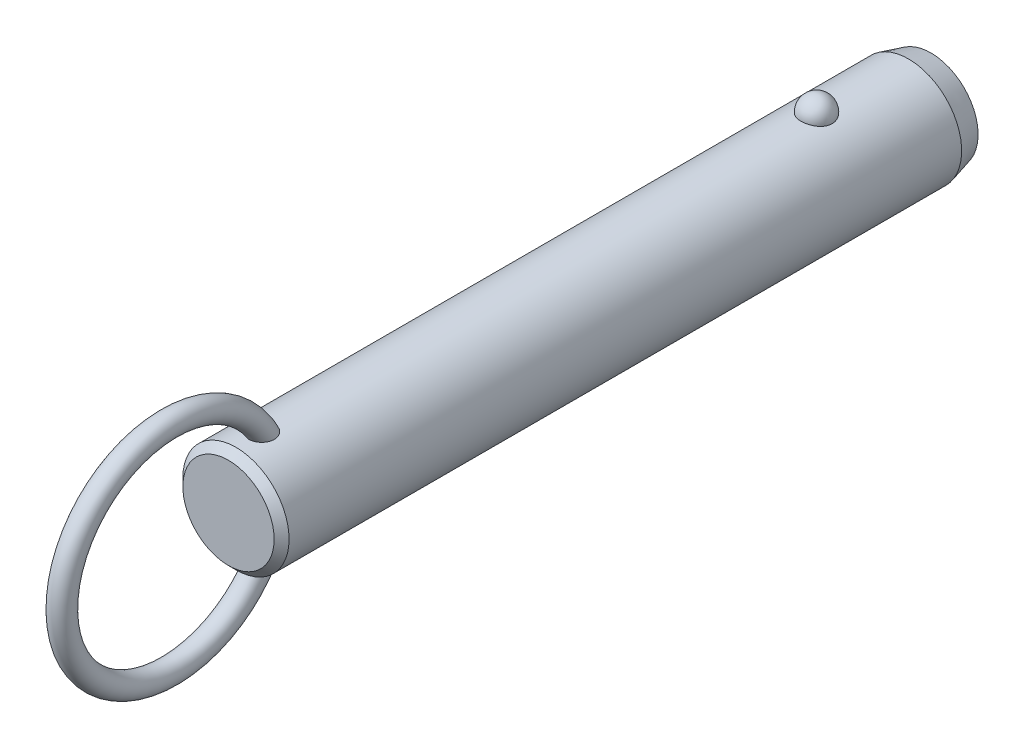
ISO-10303-21;
HEADER;
FILE_DESCRIPTION(('STEP AP214'),'2;1');
FILE_NAME('part.step','',(''),(''),'','','');
FILE_SCHEMA(('AUTOMOTIVE_DESIGN { 1 0 10303 214 1 1 1 1 }'));
ENDSEC;
DATA;
#1=APPLICATION_CONTEXT('core data for automotive mechanical design processes');
#2=APPLICATION_PROTOCOL_DEFINITION('international standard','automotive_design',2000,#1);
#3=PRODUCT_CONTEXT('',#1,'mechanical');
#4=PRODUCT('Part','Part','',(#3));
#5=PRODUCT_RELATED_PRODUCT_CATEGORY('part','',(#4));
#6=PRODUCT_DEFINITION_FORMATION('','',#4);
#7=PRODUCT_DEFINITION_CONTEXT('part definition',#1,'design');
#8=PRODUCT_DEFINITION('design','',#6,#7);
#9=PRODUCT_DEFINITION_SHAPE('','',#8);
#10=(LENGTH_UNIT() NAMED_UNIT(*) SI_UNIT(.MILLI.,.METRE.));
#11=(NAMED_UNIT(*) PLANE_ANGLE_UNIT() SI_UNIT($,.RADIAN.));
#12=(NAMED_UNIT(*) SI_UNIT($,.STERADIAN.) SOLID_ANGLE_UNIT());
#13=UNCERTAINTY_MEASURE_WITH_UNIT(LENGTH_MEASURE(1.E-05),#10,'distance_accuracy_value','');
#14=(GEOMETRIC_REPRESENTATION_CONTEXT(3) GLOBAL_UNCERTAINTY_ASSIGNED_CONTEXT((#13)) GLOBAL_UNIT_ASSIGNED_CONTEXT((#10,
#11,#12)) REPRESENTATION_CONTEXT('',''));
#15=CARTESIAN_POINT('',(0.,0.,0.));
#16=DIRECTION('',(0.,0.,1.));
#17=DIRECTION('',(1.,0.,0.));
#18=AXIS2_PLACEMENT_3D('',#15,#16,#17);
#19=CARTESIAN_POINT('',(0.,0.,68.6));
#20=DIRECTION('',(0.,0.,-1.));
#21=DIRECTION('',(-1.,0.,0.));
#22=AXIS2_PLACEMENT_3D('',#19,#20,#21);
#23=CYLINDRICAL_SURFACE('',#22,7.1);
#24=CARTESIAN_POINT('',(2.0769088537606,6.78943661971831,-2.1));
#25=CARTESIAN_POINT('',(2.07690739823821,6.78943796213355,-1.98268154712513));
#26=CARTESIAN_POINT('',(2.06738130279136,6.79237331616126,-1.86534506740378));
#27=CARTESIAN_POINT('',(2.0295040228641,6.8037853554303,-1.63400788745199));
#28=CARTESIAN_POINT('',(2.00114757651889,6.81226358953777,-1.52000812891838));
#29=CARTESIAN_POINT('',(1.92632025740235,6.83379798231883,-1.29863433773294));
#30=CARTESIAN_POINT('',(1.87985726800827,6.84685214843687,-1.19125744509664));
#31=CARTESIAN_POINT('',(1.76995205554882,6.87608091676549,-0.98604657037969));
#32=CARTESIAN_POINT('',(1.70650980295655,6.8922555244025,-0.88821260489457));
#33=CARTESIAN_POINT('',(1.5638119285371,6.92602930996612,-0.704242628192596));
#34=CARTESIAN_POINT('',(1.4844714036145,6.94363582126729,-0.618173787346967));
#35=CARTESIAN_POINT('',(1.31221746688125,6.97823658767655,-0.460740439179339));
#36=CARTESIAN_POINT('',(1.21930409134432,6.99523084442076,-0.389375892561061));
#37=CARTESIAN_POINT('',(1.02268781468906,7.02666176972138,-0.263547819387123));
#38=CARTESIAN_POINT('',(0.91902009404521,7.04110638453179,-0.209031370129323));
#39=CARTESIAN_POINT('',(0.703548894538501,7.06588726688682,-0.118163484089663));
#40=CARTESIAN_POINT('',(0.591746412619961,7.07622403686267,-0.0818098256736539));
#41=CARTESIAN_POINT('',(0.365557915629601,7.09147068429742,-0.0288711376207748));
#42=CARTESIAN_POINT('',(0.251267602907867,7.09648447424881,-0.0119070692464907));
#43=CARTESIAN_POINT('',(0.0213499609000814,7.10089837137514,0.00304925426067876));
#44=CARTESIAN_POINT('',(-0.0942772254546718,7.10029907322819,0.00104351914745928));
#45=CARTESIAN_POINT('',(-0.321651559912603,7.09360829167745,-0.0216931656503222));
#46=CARTESIAN_POINT('',(-0.433431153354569,7.08760388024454,-0.0421272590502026));
#47=CARTESIAN_POINT('',(-0.651862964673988,7.07086131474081,-0.100729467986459));
#48=CARTESIAN_POINT('',(-0.758515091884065,7.06012307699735,-0.138897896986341));
#49=CARTESIAN_POINT('',(-0.964449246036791,7.03496097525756,-0.232213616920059));
#50=CARTESIAN_POINT('',(-1.06368095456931,7.02051445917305,-0.287465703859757));
#51=CARTESIAN_POINT('',(-1.25145353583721,6.98948740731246,-0.413383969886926));
#52=CARTESIAN_POINT('',(-1.33999321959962,6.97290663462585,-0.48405186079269));
#53=CARTESIAN_POINT('',(-1.50591604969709,6.93898770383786,-0.640594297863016));
#54=CARTESIAN_POINT('',(-1.58302488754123,6.92164094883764,-0.726757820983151));
#55=CARTESIAN_POINT('',(-1.72189320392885,6.8884103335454,-0.91092752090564));
#56=CARTESIAN_POINT('',(-1.78365144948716,6.87252659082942,-1.008934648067));
#57=CARTESIAN_POINT('',(-1.89101272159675,6.84377189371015,-1.21549497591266));
#58=CARTESIAN_POINT('',(-1.93639553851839,6.83094274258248,-1.32416860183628));
#59=CARTESIAN_POINT('',(-2.00874275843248,6.81002070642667,-1.54791500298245));
#60=CARTESIAN_POINT('',(-2.03570774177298,6.80192767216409,-1.66298757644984));
#61=CARTESIAN_POINT('',(-2.07047276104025,6.7914266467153,-1.89571453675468));
#62=CARTESIAN_POINT('',(-2.07835878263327,6.78899315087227,-2.01335491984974));
#63=CARTESIAN_POINT('',(-2.07502083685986,6.79001409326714,-2.24833570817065));
#64=CARTESIAN_POINT('',(-2.06379746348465,6.7934683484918,-2.36567612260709));
#65=CARTESIAN_POINT('',(-2.02263913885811,6.80583442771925,-2.59603194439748));
#66=CARTESIAN_POINT('',(-1.99281127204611,6.81471501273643,-2.70906820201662));
#67=CARTESIAN_POINT('',(-1.91526639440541,6.83691232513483,-2.92836575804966));
#68=CARTESIAN_POINT('',(-1.8675486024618,6.85022924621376,-3.03462676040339));
#69=CARTESIAN_POINT('',(-1.75504492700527,6.87991336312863,-3.23806487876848));
#70=CARTESIAN_POINT('',(-1.69015924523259,6.89629822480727,-3.33518422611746));
#71=CARTESIAN_POINT('',(-1.54505404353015,6.93024852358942,-3.51697105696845));
#72=CARTESIAN_POINT('',(-1.46483385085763,6.94781401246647,-3.60163799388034));
#73=CARTESIAN_POINT('',(-1.29071406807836,6.98225977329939,-3.75654119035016));
#74=CARTESIAN_POINT('',(-1.19675650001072,6.99913673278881,-3.82671308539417));
#75=CARTESIAN_POINT('',(-0.997940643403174,7.03023618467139,-3.9501837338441));
#76=CARTESIAN_POINT('',(-0.89308318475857,7.04445887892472,-4.00348377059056));
#77=CARTESIAN_POINT('',(-0.676902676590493,7.06848365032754,-4.09107242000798));
#78=CARTESIAN_POINT('',(-0.565686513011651,7.0783430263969,-4.12560889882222));
#79=CARTESIAN_POINT('',(-0.338739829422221,7.09282534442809,-4.17575450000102));
#80=CARTESIAN_POINT('',(-0.223009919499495,7.09744899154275,-4.19136617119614));
#81=CARTESIAN_POINT('',(0.00707628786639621,7.10090930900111,-4.20307965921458));
#82=CARTESIAN_POINT('',(0.121410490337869,7.09986531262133,-4.19958377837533));
#83=CARTESIAN_POINT('',(0.347815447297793,7.092380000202,-4.17411564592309));
#84=CARTESIAN_POINT('',(0.459886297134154,7.08593891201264,-4.15214417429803));
#85=CARTESIAN_POINT('',(0.678084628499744,7.06838983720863,-4.09049562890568));
#86=CARTESIAN_POINT('',(0.784237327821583,7.05730369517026,-4.05090137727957));
#87=CARTESIAN_POINT('',(0.988305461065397,7.03163139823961,-3.95511447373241));
#88=CARTESIAN_POINT('',(1.08622031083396,7.01704499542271,-3.89892064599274));
#89=CARTESIAN_POINT('',(1.27284490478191,6.98562668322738,-3.77035541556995));
#90=CARTESIAN_POINT('',(1.36137372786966,6.96876135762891,-3.69772964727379));
#91=CARTESIAN_POINT('',(1.52509486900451,6.93477412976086,-3.53878279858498));
#92=CARTESIAN_POINT('',(1.60028496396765,6.91765218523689,-3.45245943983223));
#93=CARTESIAN_POINT('',(1.73681688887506,6.88465753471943,-3.26658774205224));
#94=CARTESIAN_POINT('',(1.79785966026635,6.86881574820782,-3.16681408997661));
#95=CARTESIAN_POINT('',(1.90265327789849,6.84053157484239,-2.95814408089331));
#96=CARTESIAN_POINT('',(1.94640861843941,6.82808830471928,-2.84925010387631));
#97=CARTESIAN_POINT('',(2.01274378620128,6.80881460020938,-2.63454318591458));
#98=CARTESIAN_POINT('',(2.03676193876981,6.80160856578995,-2.52920574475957));
#99=CARTESIAN_POINT('',(2.06884490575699,6.79191902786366,-2.3159172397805));
#100=CARTESIAN_POINT('',(2.07691019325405,6.78943538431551,-2.20796625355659));
#101=CARTESIAN_POINT('',(2.0769088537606,6.78943661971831,-2.1));
#102=B_SPLINE_CURVE_WITH_KNOTS('',3,(#24,#25,#26,#27,#28,#29,#30,#31,#32,#33,#34,#35,#36,#37,
#38,#39,#40,#41,#42,#43,#44,#45,#46,#47,#48,#49,#50,#51,#52,#53,#54,#55,#56,#57,#58,#59,#60,#61,
#62,#63,#64,#65,#66,#67,#68,#69,#70,#71,#72,#73,#74,#75,#76,#77,#78,#79,#80,#81,#82,#83,#84,#85,
#86,#87,#88,#89,#90,#91,#92,#93,#94,#95,#96,#97,#98,#99,#100,#101),.UNSPECIFIED.,.T.,.F.,(4,2,2,
2,2,2,2,2,2,2,2,2,2,2,2,2,2,2,2,2,2,2,2,2,2,2,2,2,2,2,2,2,2,2,2,2,2,2,4),(0.,0.351568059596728,
0.703234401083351,1.05474780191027,1.40626181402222,1.75970563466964,2.11314851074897,
2.4654696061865,2.81774759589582,3.16301449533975,3.50824481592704,3.84801136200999,
4.18778391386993,4.52968352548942,4.87162112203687,5.22076181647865,5.56993054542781,
5.92363364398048,6.27732559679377,6.62942052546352,6.98150450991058,7.33158042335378,
7.68167162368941,8.03384443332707,8.38603269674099,8.73975272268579,9.09344583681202,
9.44234545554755,9.79119807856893,10.1327344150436,10.4742563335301,10.8141898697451,
11.1541474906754,11.4997793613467,11.8454687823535,12.1979079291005,12.5502553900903,
12.8738073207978,13.1973496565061),.UNSPECIFIED.);
#103=CARTESIAN_POINT('',(2.0769088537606,6.78943661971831,-2.1));
#104=VERTEX_POINT('',#103);
#105=EDGE_CURVE('E41',#104,#104,#102,.T.);
#106=ORIENTED_EDGE('',*,*,#105,.T.);
#107=EDGE_LOOP('',(#106));
#108=FACE_BOUND('',#107,.T.);
#109=CARTESIAN_POINT('',(0.,0.,75.52));
#110=DIRECTION('',(0.,0.,1.));
#111=DIRECTION('',(1.,0.,0.));
#112=AXIS2_PLACEMENT_3D('',#109,#110,#111);
#113=CIRCLE('',#112,7.1);
#114=CARTESIAN_POINT('',(7.1,0.,75.52));
#115=VERTEX_POINT('',#114);
#116=EDGE_CURVE('E10',#115,#115,#113,.F.);
#117=ORIENTED_EDGE('',*,*,#116,.T.);
#118=EDGE_LOOP('',(#117));
#119=FACE_BOUND('',#118,.T.);
#120=CARTESIAN_POINT('',(-0.429539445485,-7.08699541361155,70.3429212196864));
#121=CARTESIAN_POINT('',(-0.508331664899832,-7.08221999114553,70.3668764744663));
#122=CARTESIAN_POINT('',(-0.58503984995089,-7.07624016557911,70.3974570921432));
#123=CARTESIAN_POINT('',(-0.732082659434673,-7.06254296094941,70.4710242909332));
#124=CARTESIAN_POINT('',(-0.802417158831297,-7.05482554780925,70.5140111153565));
#125=CARTESIAN_POINT('',(-0.934722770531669,-7.03851844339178,70.6111135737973));
#126=CARTESIAN_POINT('',(-0.99670020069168,-7.02992941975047,70.6652207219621));
#127=CARTESIAN_POINT('',(-1.11079942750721,-7.01280697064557,70.7829676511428));
#128=CARTESIAN_POINT('',(-1.16292136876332,-7.00427354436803,70.8466072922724));
#129=CARTESIAN_POINT('',(-1.25705660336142,-6.98799959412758,70.9826870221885));
#130=CARTESIAN_POINT('',(-1.29888032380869,-6.98027525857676,71.0552598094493));
#131=CARTESIAN_POINT('',(-1.37069920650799,-6.96652886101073,71.2061686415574));
#132=CARTESIAN_POINT('',(-1.40069157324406,-6.96050720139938,71.2845060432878));
#133=CARTESIAN_POINT('',(-1.45043507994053,-6.95031881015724,71.4501903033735));
#134=CARTESIAN_POINT('',(-1.46937115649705,-6.94630231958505,71.5377897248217));
#135=CARTESIAN_POINT('',(-1.49424917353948,-6.94099239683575,71.7148714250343));
#136=CARTESIAN_POINT('',(-1.50018601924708,-6.93970003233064,71.8043544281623));
#137=CARTESIAN_POINT('',(-1.49978214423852,-6.93978815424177,71.9940607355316));
#138=CARTESIAN_POINT('',(-1.49187639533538,-6.94150934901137,72.094279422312));
#139=CARTESIAN_POINT('',(-1.46177925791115,-6.94790814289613,72.2924798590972));
#140=CARTESIAN_POINT('',(-1.43957541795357,-6.95258831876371,72.390459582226));
#141=CARTESIAN_POINT('',(-1.37783293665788,-6.96510647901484,72.5953629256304));
#142=CARTESIAN_POINT('',(-1.33634073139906,-6.97328848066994,72.7016801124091));
#143=CARTESIAN_POINT('',(-1.23686994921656,-6.99161706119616,72.9061777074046));
#144=CARTESIAN_POINT('',(-1.17889192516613,-7.00176357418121,73.0043583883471));
#145=CARTESIAN_POINT('',(-1.0587512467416,-7.02082898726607,73.1723743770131));
#146=CARTESIAN_POINT('',(-0.999247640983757,-7.02963746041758,73.2441230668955));
#147=CARTESIAN_POINT('',(-0.869494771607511,-7.04686074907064,73.3771959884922));
#148=CARTESIAN_POINT('',(-0.799263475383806,-7.05527619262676,73.4385372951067));
#149=CARTESIAN_POINT('',(-0.665408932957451,-7.06899457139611,73.5351316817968));
#150=CARTESIAN_POINT('',(-0.603817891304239,-7.07457275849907,73.5731512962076));
#151=CARTESIAN_POINT('',(-0.475172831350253,-7.08437420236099,73.6387581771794));
#152=CARTESIAN_POINT('',(-0.408123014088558,-7.08859848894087,73.6663533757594));
#153=CARTESIAN_POINT('',(-0.269431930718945,-7.09522749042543,73.7092569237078));
#154=CARTESIAN_POINT('',(-0.197757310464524,-7.09761688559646,73.7244618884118));
#155=CARTESIAN_POINT('',(-0.0527849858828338,-7.10017268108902,73.7407168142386));
#156=CARTESIAN_POINT('',(0.0205115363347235,-7.10034065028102,73.7417767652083));
#157=CARTESIAN_POINT('',(0.15642613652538,-7.09855986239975,73.7304619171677));
#158=CARTESIAN_POINT('',(0.219199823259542,-7.09688191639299,73.7198060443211));
#159=CARTESIAN_POINT('',(0.342134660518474,-7.09201880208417,73.6885379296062));
#160=CARTESIAN_POINT('',(0.402295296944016,-7.08883333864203,73.6679237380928));
#161=CARTESIAN_POINT('',(0.520687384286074,-7.08113868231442,73.6172125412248));
#162=CARTESIAN_POINT('',(0.578791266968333,-7.07658958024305,73.5868272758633));
#163=CARTESIAN_POINT('',(0.690173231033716,-7.06659708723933,73.5183678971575));
#164=CARTESIAN_POINT('',(0.743447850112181,-7.061153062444,73.4802883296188));
#165=CARTESIAN_POINT('',(0.870947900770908,-7.04680292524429,73.3765929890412));
#166=CARTESIAN_POINT('',(0.941828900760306,-7.0375580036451,73.3068972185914));
#167=CARTESIAN_POINT('',(1.07136606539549,-7.01900793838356,73.1569450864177));
#168=CARTESIAN_POINT('',(1.13000013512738,-7.00970271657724,73.0766700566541));
#169=CARTESIAN_POINT('',(1.23579584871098,-6.99183327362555,72.9068997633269));
#170=CARTESIAN_POINT('',(1.2827427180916,-6.98328455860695,72.8172696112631));
#171=CARTESIAN_POINT('',(1.36351442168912,-6.96796352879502,72.6321763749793));
#172=CARTESIAN_POINT('',(1.39733971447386,-6.96119115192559,72.5367134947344));
#173=CARTESIAN_POINT('',(1.45579181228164,-6.94922464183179,72.3253092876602));
#174=CARTESIAN_POINT('',(1.47790145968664,-6.94449000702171,72.208631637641));
#175=CARTESIAN_POINT('',(1.50168752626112,-6.93938731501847,71.9730153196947));
#176=CARTESIAN_POINT('',(1.50336085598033,-6.93901991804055,71.8540763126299));
#177=CARTESIAN_POINT('',(1.48486516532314,-6.9430010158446,71.6236079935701));
#178=CARTESIAN_POINT('',(1.46573441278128,-6.9471253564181,71.511995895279));
#179=CARTESIAN_POINT('',(1.40606892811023,-6.95944667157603,71.2948868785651));
#180=CARTESIAN_POINT('',(1.36556446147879,-6.96763788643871,71.1893815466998));
#181=CARTESIAN_POINT('',(1.27082700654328,-6.98548038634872,71.0042879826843));
#182=CARTESIAN_POINT('',(1.21949810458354,-6.99473841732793,70.9231719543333));
#183=CARTESIAN_POINT('',(1.10242050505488,-7.01414069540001,70.7722278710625));
#184=CARTESIAN_POINT('',(1.03668119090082,-7.02428436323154,70.7023925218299));
#185=CARTESIAN_POINT('',(0.900559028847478,-7.04295285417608,70.5835735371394));
#186=CARTESIAN_POINT('',(0.83142884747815,-7.05153466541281,70.5331573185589));
#187=CARTESIAN_POINT('',(0.68529187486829,-7.06723150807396,70.4451429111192));
#188=CARTESIAN_POINT('',(0.608287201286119,-7.0743469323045,70.4075412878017));
#189=CARTESIAN_POINT('',(0.451878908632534,-7.08602232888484,70.3474915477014));
#190=CARTESIAN_POINT('',(0.372686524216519,-7.09067127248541,70.3245088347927));
#191=CARTESIAN_POINT('',(0.211477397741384,-7.09730788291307,70.2920357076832));
#192=CARTESIAN_POINT('',(0.129460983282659,-7.09929585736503,70.2825437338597));
#193=CARTESIAN_POINT('',(-0.0332905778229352,-7.10037858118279,70.2773517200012));
#194=CARTESIAN_POINT('',(-0.11401636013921,-7.09953334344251,70.2813656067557));
#195=CARTESIAN_POINT('',(-0.273670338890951,-7.09517338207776,70.3024540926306));
#196=CARTESIAN_POINT('',(-0.352598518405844,-7.09165863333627,70.3195288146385));
#197=CARTESIAN_POINT('',(-0.429539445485,-7.08699541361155,70.3429212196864));
#198=B_SPLINE_CURVE_WITH_KNOTS('',3,(#120,#121,#122,#123,#124,#125,#126,#127,#128,#129,#130,
#131,#132,#133,#134,#135,#136,#137,#138,#139,#140,#141,#142,#143,#144,#145,#146,#147,#148,#149,
#150,#151,#152,#153,#154,#155,#156,#157,#158,#159,#160,#161,#162,#163,#164,#165,#166,#167,#168,
#169,#170,#171,#172,#173,#174,#175,#176,#177,#178,#179,#180,#181,#182,#183,#184,#185,#186,#187,
#188,#189,#190,#191,#192,#193,#194,#195,#196,#197),.UNSPECIFIED.,.T.,.F.,(4,2,2,2,2,2,2,2,2,2,2,
2,2,2,2,2,2,2,2,2,2,2,2,2,2,2,2,2,2,2,2,2,2,2,2,2,2,2,4),(0.,0.247183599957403,
0.494372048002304,0.741372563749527,0.988369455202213,1.23962059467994,1.49093106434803,
1.75897818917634,2.02713035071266,2.32758265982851,2.62829697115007,2.97008736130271,
3.31186629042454,3.59175319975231,3.87117637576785,4.08813841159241,4.30493502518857,
4.52352259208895,4.74195577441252,4.9321532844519,5.12238804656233,5.31884850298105,
5.51544871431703,5.81332317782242,6.11173048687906,6.4152726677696,6.71880423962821,
7.07358156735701,7.42841252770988,7.76631485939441,8.10373999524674,8.39142246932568,
8.67891817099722,8.93560332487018,9.19221962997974,9.43881106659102,9.68537399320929,
9.92674752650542,10.1681233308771),.UNSPECIFIED.);
#199=CARTESIAN_POINT('',(-0.429539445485,-7.08699541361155,70.3429212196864));
#200=VERTEX_POINT('',#199);
#201=EDGE_CURVE('E59',#200,#200,#198,.T.);
#202=ORIENTED_EDGE('',*,*,#201,.T.);
#203=EDGE_LOOP('',(#202));
#204=FACE_BOUND('',#203,.T.);
#205=CARTESIAN_POINT('',(-0.429539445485,7.08699541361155,70.3429212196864));
#206=CARTESIAN_POINT('',(-0.351665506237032,7.09171429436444,70.3192469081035));
#207=CARTESIAN_POINT('',(-0.271733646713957,7.09525896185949,70.3020369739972));
#208=CARTESIAN_POINT('',(-0.110026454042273,7.09960839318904,70.2810059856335));
#209=CARTESIAN_POINT('',(-0.028250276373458,7.10041187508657,70.277191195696));
#210=CARTESIAN_POINT('',(0.134782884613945,7.09918849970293,70.283059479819));
#211=CARTESIAN_POINT('',(0.21603995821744,7.09716214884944,70.2927401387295));
#212=CARTESIAN_POINT('',(0.375730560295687,7.09050177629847,70.3253471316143));
#213=CARTESIAN_POINT('',(0.454164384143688,7.08586802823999,70.3482720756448));
#214=CARTESIAN_POINT('',(0.60602533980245,7.07449911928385,70.406771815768));
#215=CARTESIAN_POINT('',(0.679451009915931,7.06776334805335,70.4423502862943));
#216=CARTESIAN_POINT('',(0.819234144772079,7.05292866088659,70.5251753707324));
#217=CARTESIAN_POINT('',(0.885591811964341,7.04482978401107,70.5724216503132));
#218=CARTESIAN_POINT('',(1.00993211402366,7.02808709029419,70.6775902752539));
#219=CARTESIAN_POINT('',(1.06785399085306,7.01943990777,70.735583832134));
#220=CARTESIAN_POINT('',(1.17342527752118,7.00256662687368,70.8603013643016));
#221=CARTESIAN_POINT('',(1.22107408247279,6.99434055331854,70.9270258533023));
#222=CARTESIAN_POINT('',(1.30652927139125,6.97889183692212,71.0693622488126));
#223=CARTESIAN_POINT('',(1.34399711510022,6.97170674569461,71.1451808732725));
#224=CARTESIAN_POINT('',(1.40682616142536,6.95930080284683,71.3018100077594));
#225=CARTESIAN_POINT('',(1.43218374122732,6.95408053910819,71.3826220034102));
#226=CARTESIAN_POINT('',(1.47246409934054,6.94566853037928,71.5535314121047));
#227=CARTESIAN_POINT('',(1.48642590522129,6.9426653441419,71.6438630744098));
#228=CARTESIAN_POINT('',(1.5011410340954,6.93949744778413,71.825619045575));
#229=CARTESIAN_POINT('',(1.50188917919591,6.93933385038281,71.9170437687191));
#230=CARTESIAN_POINT('',(1.49030464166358,6.94183245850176,72.1108438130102));
#231=CARTESIAN_POINT('',(1.47627413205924,6.94486147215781,72.213112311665));
#232=CARTESIAN_POINT('',(1.43356351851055,6.95380194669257,72.4144719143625));
#233=CARTESIAN_POINT('',(1.4048676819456,6.95971650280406,72.5135594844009));
#234=CARTESIAN_POINT('',(1.32908750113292,6.97461208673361,72.7189087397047));
#235=CARTESIAN_POINT('',(1.28011435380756,6.98388945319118,72.8244566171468));
#236=CARTESIAN_POINT('',(1.16520357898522,7.00397743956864,73.0257604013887));
#237=CARTESIAN_POINT('',(1.09927694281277,7.01478706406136,73.1215225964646));
#238=CARTESIAN_POINT('',(0.969361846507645,7.03373936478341,73.2767565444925));
#239=CARTESIAN_POINT('',(0.909042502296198,7.04187023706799,73.3393032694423));
#240=CARTESIAN_POINT('',(0.77917855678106,7.0574173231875,73.4540535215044));
#241=CARTESIAN_POINT('',(0.70964977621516,7.06483472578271,73.5062744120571));
#242=CARTESIAN_POINT('',(0.576854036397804,7.0767751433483,73.5881138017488));
#243=CARTESIAN_POINT('',(0.515118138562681,7.08158033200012,73.6201641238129));
#244=CARTESIAN_POINT('',(0.387127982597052,7.08972701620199,73.6737656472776));
#245=CARTESIAN_POINT('',(0.320877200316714,7.09306962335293,73.6953248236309));
#246=CARTESIAN_POINT('',(0.185041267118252,7.09791507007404,73.7264005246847));
#247=CARTESIAN_POINT('',(0.115437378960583,7.09940591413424,73.7358385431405));
#248=CARTESIAN_POINT('',(-0.0243157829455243,7.10030171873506,73.7415226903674));
#249=CARTESIAN_POINT('',(-0.0944648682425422,7.0997073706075,73.7377731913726));
#250=CARTESIAN_POINT('',(-0.225713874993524,7.09668414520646,73.7185081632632));
#251=CARTESIAN_POINT('',(-0.287006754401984,7.09444865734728,73.7042323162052));
#252=CARTESIAN_POINT('',(-0.40655537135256,7.08860360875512,73.6663685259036));
#253=CARTESIAN_POINT('',(-0.46480981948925,7.08499346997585,73.6427766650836));
#254=CARTESIAN_POINT('',(-0.594955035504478,7.07541654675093,73.5789232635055));
#255=CARTESIAN_POINT('',(-0.665389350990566,7.06906574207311,73.535753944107));
#256=CARTESIAN_POINT('',(-0.798242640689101,7.05530261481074,73.438587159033));
#257=CARTESIAN_POINT('',(-0.860645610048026,7.0478882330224,73.3845686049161));
#258=CARTESIAN_POINT('',(-0.994249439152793,7.03045217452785,73.2509965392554));
#259=CARTESIAN_POINT('',(-1.06260129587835,7.02030745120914,73.1686143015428));
#260=CARTESIAN_POINT('',(-1.18502045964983,7.00068382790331,72.9938439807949));
#261=CARTESIAN_POINT('',(-1.23907684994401,6.99120544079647,72.901448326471));
#262=CARTESIAN_POINT('',(-1.33335589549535,6.97384343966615,72.7080085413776));
#263=CARTESIAN_POINT('',(-1.37336138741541,6.96598557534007,72.6068564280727));
#264=CARTESIAN_POINT('',(-1.43770677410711,6.9529905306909,72.3995046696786));
#265=CARTESIAN_POINT('',(-1.46204473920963,6.94785368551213,72.29330440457));
#266=CARTESIAN_POINT('',(-1.49537533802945,6.94076296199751,72.0682317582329));
#267=CARTESIAN_POINT('',(-1.50273564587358,6.93914842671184,71.9490975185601));
#268=CARTESIAN_POINT('',(-1.4954555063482,6.94072368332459,71.7114703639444));
#269=CARTESIAN_POINT('',(-1.48082914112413,6.94391040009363,71.5929770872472));
#270=CARTESIAN_POINT('',(-1.43076401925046,6.95438579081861,71.3734325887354));
#271=CARTESIAN_POINT('',(-1.39762227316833,6.96121852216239,71.2718413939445));
#272=CARTESIAN_POINT('',(-1.31211274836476,6.97783941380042,71.0773513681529));
#273=CARTESIAN_POINT('',(-1.2597660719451,6.98762432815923,70.9844431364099));
#274=CARTESIAN_POINT('',(-1.14583073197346,7.00713153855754,70.8241601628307));
#275=CARTESIAN_POINT('',(-1.0866594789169,7.01665982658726,70.7550351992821));
#276=CARTESIAN_POINT('',(-0.956606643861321,7.03556646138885,70.6288786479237));
#277=CARTESIAN_POINT('',(-0.88573712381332,7.04494495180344,70.5718347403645));
#278=CARTESIAN_POINT('',(-0.75155804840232,7.06035735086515,70.4831004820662));
#279=CARTESIAN_POINT('',(-0.690120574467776,7.0666695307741,70.4485932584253));
#280=CARTESIAN_POINT('',(-0.562815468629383,7.07794609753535,70.3887507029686));
#281=CARTESIAN_POINT('',(-0.496948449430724,7.08291067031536,70.3634141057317));
#282=CARTESIAN_POINT('',(-0.429539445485,7.08699541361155,70.3429212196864));
#283=B_SPLINE_CURVE_WITH_KNOTS('',3,(#205,#206,#207,#208,#209,#210,#211,#212,#213,#214,#215,
#216,#217,#218,#219,#220,#221,#222,#223,#224,#225,#226,#227,#228,#229,#230,#231,#232,#233,#234,
#235,#236,#237,#238,#239,#240,#241,#242,#243,#244,#245,#246,#247,#248,#249,#250,#251,#252,#253,
#254,#255,#256,#257,#258,#259,#260,#261,#262,#263,#264,#265,#266,#267,#268,#269,#270,#271,#272,
#273,#274,#275,#276,#277,#278,#279,#280,#281,#282),.UNSPECIFIED.,.T.,.F.,(4,2,2,2,2,2,2,2,2,2,2,
2,2,2,2,2,2,2,2,2,2,2,2,2,2,2,2,2,2,2,2,2,2,2,2,2,2,2,4),(0.,0.244335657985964,
0.488785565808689,0.733191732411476,0.977572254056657,1.22202379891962,1.46646834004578,
1.71259457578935,1.95873529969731,2.21226768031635,2.46587585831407,2.7391381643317,
3.01250754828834,3.32109936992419,3.63002293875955,3.97863512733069,4.32702187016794,
4.5879394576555,4.84841449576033,5.05676704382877,5.26496096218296,5.47449661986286,
5.68396281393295,5.87205447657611,6.06022532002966,6.30743751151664,6.55513496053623,
6.87602468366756,7.19715875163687,7.52305774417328,7.84899686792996,8.20516155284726,
8.56109821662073,8.8804008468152,9.19935367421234,9.47236282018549,9.74509220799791,
9.9566225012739,10.1681235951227),.UNSPECIFIED.);
#284=CARTESIAN_POINT('',(-0.429539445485,7.08699541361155,70.3429212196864));
#285=VERTEX_POINT('',#284);
#286=EDGE_CURVE('E67',#285,#285,#283,.T.);
#287=ORIENTED_EDGE('',*,*,#286,.T.);
#288=EDGE_LOOP('',(#287));
#289=FACE_BOUND('',#288,.T.);
#290=CARTESIAN_POINT('',(0.,0.,-14.3999999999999));
#291=DIRECTION('',(0.,0.,-1.));
#292=DIRECTION('',(-1.,0.,0.));
#293=AXIS2_PLACEMENT_3D('',#290,#291,#292);
#294=CIRCLE('',#293,7.1);
#295=CARTESIAN_POINT('',(-7.1,0.,-14.3999999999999));
#296=VERTEX_POINT('',#295);
#297=EDGE_CURVE('E56',#296,#296,#294,.F.);
#298=ORIENTED_EDGE('',*,*,#297,.T.);
#299=EDGE_LOOP('',(#298));
#300=FACE_BOUND('',#299,.T.);
#301=ADVANCED_FACE('F37',(#108,#119,#204,#289,#300),#23,.T.);
#302=CARTESIAN_POINT('',(0.,0.,-17.4));
#303=DIRECTION('',(0.,0.,-1.));
#304=DIRECTION('',(-1.,0.,0.));
#305=AXIS2_PLACEMENT_3D('',#302,#303,#304);
#306=PLANE('',#305);
#307=CARTESIAN_POINT('',(0.,0.,-17.4));
#308=DIRECTION('',(0.,0.,-1.));
#309=DIRECTION('',(-1.,0.,0.));
#310=AXIS2_PLACEMENT_3D('',#307,#308,#309);
#311=CIRCLE('',#310,6.29615242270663);
#312=CARTESIAN_POINT('',(-6.29615242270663,0.,-17.4));
#313=VERTEX_POINT('',#312);
#314=EDGE_CURVE('E66',#313,#313,#311,.T.);
#315=ORIENTED_EDGE('',*,*,#314,.T.);
#316=EDGE_LOOP('',(#315));
#317=FACE_BOUND('',#316,.T.);
#318=ADVANCED_FACE('F85',(#317),#306,.T.);
#319=CARTESIAN_POINT('',(0.,0.,-17.4));
#320=DIRECTION('',(0.,0.,1.));
#321=DIRECTION('',(1.,0.,0.));
#322=AXIS2_PLACEMENT_3D('',#319,#320,#321);
#323=CONICAL_SURFACE('',#322,6.29615242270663,0.261799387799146);
#324=ORIENTED_EDGE('',*,*,#297,.F.);
#325=EDGE_LOOP('',(#324));
#326=FACE_BOUND('',#325,.T.);
#327=ORIENTED_EDGE('',*,*,#314,.F.);
#328=EDGE_LOOP('',(#327));
#329=FACE_BOUND('',#328,.T.);
#330=ADVANCED_FACE('F83',(#326,#329),#323,.T.);
#331=CARTESIAN_POINT('',(0.,0.,76.52));
#332=DIRECTION('',(0.,0.,1.));
#333=DIRECTION('',(1.,0.,0.));
#334=AXIS2_PLACEMENT_3D('',#331,#332,#333);
#335=PLANE('',#334);
#336=CARTESIAN_POINT('',(0.,0.,76.52));
#337=DIRECTION('',(0.,0.,1.));
#338=DIRECTION('',(1.,0.,0.));
#339=AXIS2_PLACEMENT_3D('',#336,#337,#338);
#340=CIRCLE('',#339,6.10000000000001);
#341=CARTESIAN_POINT('',(6.10000000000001,0.,76.52));
#342=VERTEX_POINT('',#341);
#343=EDGE_CURVE('E50',#342,#342,#340,.T.);
#344=ORIENTED_EDGE('',*,*,#343,.T.);
#345=EDGE_LOOP('',(#344));
#346=FACE_BOUND('',#345,.T.);
#347=ADVANCED_FACE('F77',(#346),#335,.T.);
#348=CARTESIAN_POINT('',(0.,0.,84.45));
#349=DIRECTION('',(1.,0.,0.));
#350=DIRECTION('',(0.,0.,-1.));
#351=AXIS2_PLACEMENT_3D('',#348,#349,#350);
#352=TOROIDAL_SURFACE('',#351,14.35,1.5);
#353=ORIENTED_EDGE('',*,*,#286,.F.);
#354=EDGE_LOOP('',(#353));
#355=FACE_BOUND('',#354,.T.);
#356=ORIENTED_EDGE('',*,*,#201,.F.);
#357=EDGE_LOOP('',(#356));
#358=FACE_BOUND('',#357,.T.);
#359=ADVANCED_FACE('F73',(#355,#358),#352,.T.);
#360=CARTESIAN_POINT('',(0.,0.,76.52));
#361=DIRECTION('',(0.,0.,-1.));
#362=DIRECTION('',(-1.,0.,0.));
#363=AXIS2_PLACEMENT_3D('',#360,#361,#362);
#364=CONICAL_SURFACE('',#363,6.10000000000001,0.785398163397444);
#365=ORIENTED_EDGE('',*,*,#116,.F.);
#366=EDGE_LOOP('',(#365));
#367=FACE_BOUND('',#366,.T.);
#368=ORIENTED_EDGE('',*,*,#343,.F.);
#369=EDGE_LOOP('',(#368));
#370=FACE_BOUND('',#369,.T.);
#371=ADVANCED_FACE('F39',(#367,#370),#364,.T.);
#372=CARTESIAN_POINT('',(0.,7.1,-2.1));
#373=DIRECTION('',(0.,1.,0.));
#374=DIRECTION('',(0.,0.,1.));
#375=AXIS2_PLACEMENT_3D('',#372,#373,#374);
#376=SPHERICAL_SURFACE('',#375,2.10000000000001);
#377=ORIENTED_EDGE('',*,*,#105,.F.);
#378=EDGE_LOOP('',(#377));
#379=FACE_BOUND('',#378,.T.);
#380=ADVANCED_FACE('F79',(#379),#376,.T.);
#381=CLOSED_SHELL('',(#301,#318,#330,#347,#359,#371,#380));
#382=MANIFOLD_SOLID_BREP('B2',#381);
#383=ADVANCED_BREP_SHAPE_REPRESENTATION('',(#18,#382),#14);
#384=SHAPE_DEFINITION_REPRESENTATION(#9,#383);
ENDSEC;
END-ISO-10303-21;
